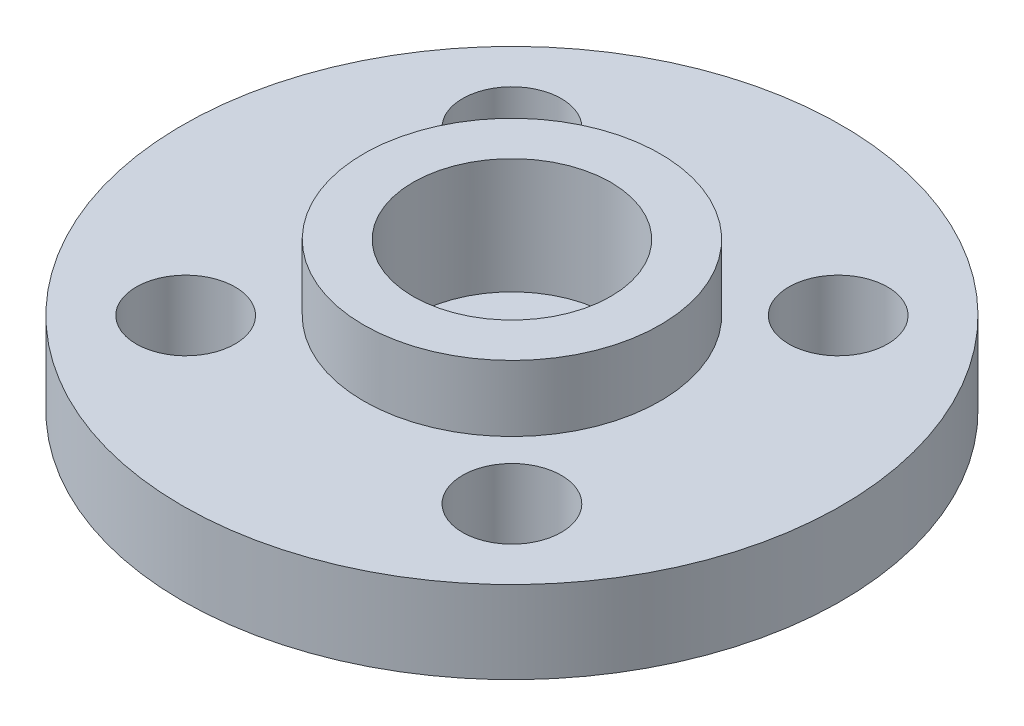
from build123d import *

# Parameters (mm, degrees)
SKETCH1_R           = 10
SKETCH1_R_2         = 1.5
SKETCH1_R_3         = 3
BOSS_EXTRUDE1_DEPTH = 2.5
SKETCH2_R           = 4.5
SKETCH2_R_2         = 3
BOSS_EXTRUDE2_DEPTH = 2
SKETCH3_R           = 3
SKETCH3_R_2         = 1
BOSS_EXTRUDE3_DEPTH = 1


with BuildPart() as part:
    # Sketch1 → Boss-Extrude1 (new body)
    with BuildSketch(Plane(origin=(0, 0, 0), x_dir=(1, 0, 0), z_dir=(0, 1, 0))):
        with Locations(Location((0, 0, 0), (0, 0, 270))):
            Circle(SKETCH1_R)
        with Locations(Location((4.949747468, 4.949747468, 0), (0, 0, 270))):
            Circle(SKETCH1_R_2, mode=Mode.SUBTRACT)
        with Locations(Location((4.949747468, -4.949747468, 0), (0, 0, 270))):
            Circle(SKETCH1_R_2, mode=Mode.SUBTRACT)
        with Locations(Location((-4.949747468, -4.949747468, 0), (0, 0, 270))):
            Circle(SKETCH1_R_2, mode=Mode.SUBTRACT)
        with Locations(Location((-4.949747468, 4.949747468, 0), (0, 0, 270))):
            Circle(SKETCH1_R_2, mode=Mode.SUBTRACT)
        with Locations(Location((0, 0, 0), (0, 0, 270))):
            Circle(SKETCH1_R_3, mode=Mode.SUBTRACT)
    extrude(amount=BOSS_EXTRUDE1_DEPTH)

    # Sketch2 → Boss-Extrude2 (add)
    with BuildSketch(Plane(origin=(0, 2.5, 0), x_dir=(1, 0, 0), z_dir=(0, 1, 0))):
        with Locations(Location((0, 0, 0), (0, 0, 270))):
            Circle(SKETCH2_R)
        with Locations(Location((0, 0, 0), (0, 0, 270))):
            Circle(SKETCH2_R_2, mode=Mode.SUBTRACT)
    extrude(amount=BOSS_EXTRUDE2_DEPTH)

    # Sketch3 → Boss-Extrude3 (add)
    with BuildSketch(Plane.XZ):
        with Locations(Location((0, 0, 0), (0, 0, 270))):
            Circle(SKETCH3_R)
        with Locations(Location((0, 0, 0), (0, 0, 270))):
            Circle(SKETCH3_R_2, mode=Mode.SUBTRACT)
    extrude(amount=-BOSS_EXTRUDE3_DEPTH)


solid = part.part
